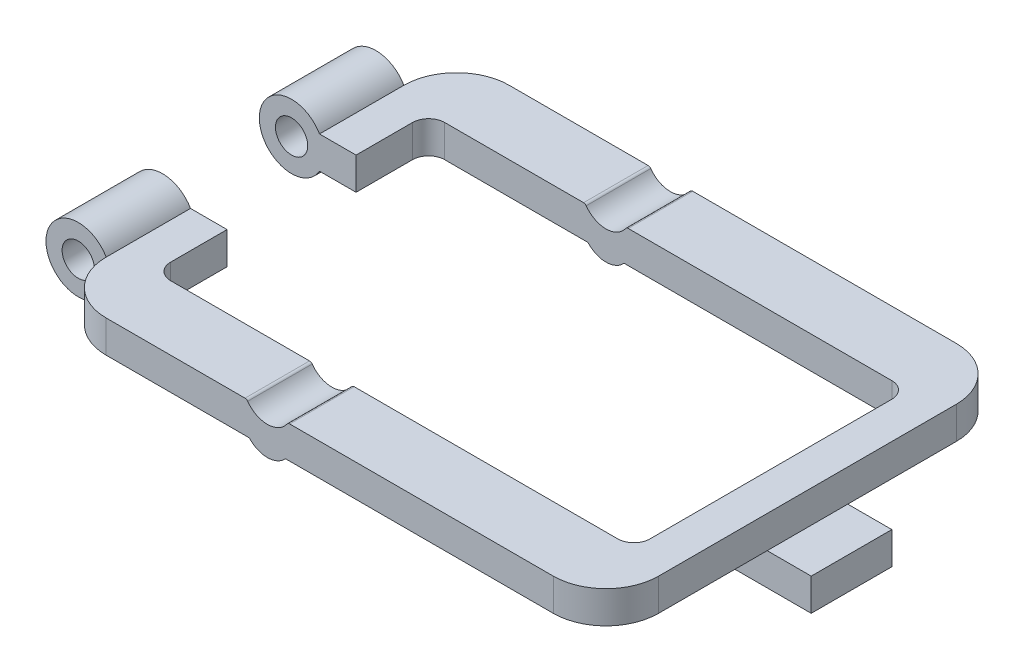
ISO-10303-21;
HEADER;
FILE_DESCRIPTION(('STEP AP214'),'2;1');
FILE_NAME('part.step','',(''),(''),'','','');
FILE_SCHEMA(('AUTOMOTIVE_DESIGN { 1 0 10303 214 1 1 1 1 }'));
ENDSEC;
DATA;
#1=APPLICATION_CONTEXT('core data for automotive mechanical design processes');
#2=APPLICATION_PROTOCOL_DEFINITION('international standard','automotive_design',2000,#1);
#3=PRODUCT_CONTEXT('',#1,'mechanical');
#4=PRODUCT('Part','Part','',(#3));
#5=PRODUCT_RELATED_PRODUCT_CATEGORY('part','',(#4));
#6=PRODUCT_DEFINITION_FORMATION('','',#4);
#7=PRODUCT_DEFINITION_CONTEXT('part definition',#1,'design');
#8=PRODUCT_DEFINITION('design','',#6,#7);
#9=PRODUCT_DEFINITION_SHAPE('','',#8);
#10=(LENGTH_UNIT() NAMED_UNIT(*) SI_UNIT(.MILLI.,.METRE.));
#11=(NAMED_UNIT(*) PLANE_ANGLE_UNIT() SI_UNIT($,.RADIAN.));
#12=(NAMED_UNIT(*) SI_UNIT($,.STERADIAN.) SOLID_ANGLE_UNIT());
#13=UNCERTAINTY_MEASURE_WITH_UNIT(LENGTH_MEASURE(1.E-05),#10,'distance_accuracy_value','');
#14=(GEOMETRIC_REPRESENTATION_CONTEXT(3) GLOBAL_UNCERTAINTY_ASSIGNED_CONTEXT((#13)) GLOBAL_UNIT_ASSIGNED_CONTEXT((#10,
#11,#12)) REPRESENTATION_CONTEXT('',''));
#15=CARTESIAN_POINT('',(0.,0.,0.));
#16=DIRECTION('',(0.,0.,1.));
#17=DIRECTION('',(1.,0.,0.));
#18=AXIS2_PLACEMENT_3D('',#15,#16,#17);
#19=CARTESIAN_POINT('',(360.,10.,125.));
#20=DIRECTION('',(0.,-1.,0.));
#21=DIRECTION('',(1.,0.,0.));
#22=AXIS2_PLACEMENT_3D('',#19,#20,#21);
#23=PLANE('',#22);
#24=DIRECTION('',(-1.,0.,0.));
#25=VECTOR('',#24,1.);
#26=CARTESIAN_POINT('',(360.,10.,-125.));
#27=LINE('',#26,#25);
#28=CARTESIAN_POINT('',(327.32,9.99999999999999,-125.));
#29=VERTEX_POINT('',#28);
#30=CARTESIAN_POINT('',(163.855539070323,9.99999999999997,-125.));
#31=VERTEX_POINT('',#30);
#32=EDGE_CURVE('E494',#29,#31,#27,.T.);
#33=ORIENTED_EDGE('',*,*,#32,.T.);
#34=DIRECTION('',(0.,0.,1.));
#35=VECTOR('',#34,1.);
#36=CARTESIAN_POINT('',(163.855539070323,9.99999999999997,125.));
#37=LINE('',#36,#35);
#38=CARTESIAN_POINT('',(163.855539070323,9.99999999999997,-85.));
#39=VERTEX_POINT('',#38);
#40=EDGE_CURVE('E558',#31,#39,#37,.T.);
#41=ORIENTED_EDGE('',*,*,#40,.T.);
#42=DIRECTION('',(-1.,0.,0.));
#43=VECTOR('',#42,1.);
#44=CARTESIAN_POINT('',(50.0000000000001,9.99999999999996,-85.));
#45=LINE('',#44,#43);
#46=CARTESIAN_POINT('',(327.32,9.99999999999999,-85.));
#47=VERTEX_POINT('',#46);
#48=EDGE_CURVE('E416',#47,#39,#45,.T.);
#49=ORIENTED_EDGE('',*,*,#48,.F.);
#50=CARTESIAN_POINT('',(327.32,9.99999999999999,-75.));
#51=DIRECTION('',(0.,1.,0.));
#52=DIRECTION('',(1.,0.,0.));
#53=AXIS2_PLACEMENT_3D('',#50,#51,#52);
#54=CIRCLE('',#53,10.);
#55=CARTESIAN_POINT('',(337.32,9.99999999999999,-75.));
#56=VERTEX_POINT('',#55);
#57=EDGE_CURVE('E413',#56,#47,#54,.T.);
#58=ORIENTED_EDGE('',*,*,#57,.F.);
#59=DIRECTION('',(0.,0.,-1.));
#60=VECTOR('',#59,1.);
#61=CARTESIAN_POINT('',(337.32,9.99999999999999,-75.));
#62=LINE('',#61,#60);
#63=CARTESIAN_POINT('',(337.32,9.99999999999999,75.));
#64=VERTEX_POINT('',#63);
#65=EDGE_CURVE('E436',#64,#56,#62,.T.);
#66=ORIENTED_EDGE('',*,*,#65,.F.);
#67=CARTESIAN_POINT('',(327.32,9.99999999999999,75.));
#68=DIRECTION('',(0.,1.,0.));
#69=DIRECTION('',(1.,0.,0.));
#70=AXIS2_PLACEMENT_3D('',#67,#68,#69);
#71=CIRCLE('',#70,10.);
#72=CARTESIAN_POINT('',(327.32,9.99999999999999,85.));
#73=VERTEX_POINT('',#72);
#74=EDGE_CURVE('E433',#73,#64,#71,.T.);
#75=ORIENTED_EDGE('',*,*,#74,.F.);
#76=DIRECTION('',(1.,0.,0.));
#77=VECTOR('',#76,1.);
#78=CARTESIAN_POINT('',(50.0000000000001,9.99999999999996,85.));
#79=LINE('',#78,#77);
#80=CARTESIAN_POINT('',(163.855539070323,9.99999999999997,85.));
#81=VERTEX_POINT('',#80);
#82=EDGE_CURVE('E429',#81,#73,#79,.T.);
#83=ORIENTED_EDGE('',*,*,#82,.F.);
#84=DIRECTION('',(0.,0.,1.));
#85=VECTOR('',#84,1.);
#86=CARTESIAN_POINT('',(163.855539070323,9.99999999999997,125.));
#87=LINE('',#86,#85);
#88=CARTESIAN_POINT('',(163.855539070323,9.99999999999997,125.));
#89=VERTEX_POINT('',#88);
#90=EDGE_CURVE('E555',#81,#89,#87,.T.);
#91=ORIENTED_EDGE('',*,*,#90,.T.);
#92=DIRECTION('',(-1.,0.,0.));
#93=VECTOR('',#92,1.);
#94=CARTESIAN_POINT('',(360.,10.,125.));
#95=LINE('',#94,#93);
#96=CARTESIAN_POINT('',(327.32,9.99999999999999,125.));
#97=VERTEX_POINT('',#96);
#98=EDGE_CURVE('E485',#97,#89,#95,.T.);
#99=ORIENTED_EDGE('',*,*,#98,.F.);
#100=CARTESIAN_POINT('',(327.32,10.,92.3205080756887));
#101=DIRECTION('',(0.,-1.,0.));
#102=DIRECTION('',(1.,0.,0.));
#103=AXIS2_PLACEMENT_3D('',#100,#101,#102);
#104=CIRCLE('',#103,32.6794919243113);
#105=CARTESIAN_POINT('',(359.999491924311,9.99999999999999,92.3205080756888));
#106=VERTEX_POINT('',#105);
#107=EDGE_CURVE('E364',#97,#106,#104,.F.);
#108=ORIENTED_EDGE('',*,*,#107,.T.);
#109=DIRECTION('',(1.,0.,0.));
#110=VECTOR('',#109,1.);
#111=CARTESIAN_POINT('',(360.,10.,92.3205080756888));
#112=LINE('',#111,#110);
#113=CARTESIAN_POINT('',(360.,10.,92.3205080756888));
#114=VERTEX_POINT('',#113);
#115=EDGE_CURVE('E361',#106,#114,#112,.T.);
#116=ORIENTED_EDGE('',*,*,#115,.T.);
#117=DIRECTION('',(0.,0.,-1.));
#118=VECTOR('',#117,1.);
#119=CARTESIAN_POINT('',(360.,10.,125.));
#120=LINE('',#119,#118);
#121=CARTESIAN_POINT('',(360.,10.,-92.3205080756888));
#122=VERTEX_POINT('',#121);
#123=EDGE_CURVE('E510',#114,#122,#120,.T.);
#124=ORIENTED_EDGE('',*,*,#123,.T.);
#125=DIRECTION('',(-1.,0.,0.));
#126=VECTOR('',#125,1.);
#127=CARTESIAN_POINT('',(360.,10.,-92.3205080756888));
#128=LINE('',#127,#126);
#129=CARTESIAN_POINT('',(359.999491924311,9.99999999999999,-92.3205080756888));
#130=VERTEX_POINT('',#129);
#131=EDGE_CURVE('E346',#122,#130,#128,.T.);
#132=ORIENTED_EDGE('',*,*,#131,.T.);
#133=CARTESIAN_POINT('',(327.32,10.,-92.3205080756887));
#134=DIRECTION('',(0.,-1.,0.));
#135=DIRECTION('',(1.,0.,0.));
#136=AXIS2_PLACEMENT_3D('',#133,#134,#135);
#137=CIRCLE('',#136,32.6794919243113);
#138=EDGE_CURVE('E349',#130,#29,#137,.F.);
#139=ORIENTED_EDGE('',*,*,#138,.T.);
#140=EDGE_LOOP('',(#33,#41,#49,#58,#66,#75,#83,#91,#99,#108,#116,#124,#132,#139));
#141=FACE_BOUND('',#140,.T.);
#142=ADVANCED_FACE('F31',(#141),#23,.F.);
#143=CARTESIAN_POINT('',(136.144460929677,9.99999999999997,125.));
#144=VERTEX_POINT('',#143);
#145=CARTESIAN_POINT('',(50.,9.99999999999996,125.));
#146=VERTEX_POINT('',#145);
#147=EDGE_CURVE('E489',#144,#146,#95,.T.);
#148=ORIENTED_EDGE('',*,*,#147,.F.);
#149=DIRECTION('',(0.,0.,1.));
#150=VECTOR('',#149,1.);
#151=CARTESIAN_POINT('',(136.144460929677,9.99999999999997,125.));
#152=LINE('',#151,#150);
#153=CARTESIAN_POINT('',(136.144460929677,9.99999999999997,85.));
#154=VERTEX_POINT('',#153);
#155=EDGE_CURVE('E589',#144,#154,#152,.F.);
#156=ORIENTED_EDGE('',*,*,#155,.T.);
#157=CARTESIAN_POINT('',(50.0000000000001,9.99999999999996,85.));
#158=VERTEX_POINT('',#157);
#159=EDGE_CURVE('E430',#158,#154,#79,.T.);
#160=ORIENTED_EDGE('',*,*,#159,.F.);
#161=CARTESIAN_POINT('',(50.,9.99999999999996,75.));
#162=DIRECTION('',(0.,1.,0.));
#163=DIRECTION('',(1.,0.,0.));
#164=AXIS2_PLACEMENT_3D('',#161,#162,#163);
#165=CIRCLE('',#164,9.99999999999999);
#166=CARTESIAN_POINT('',(40.,9.99999999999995,74.9999999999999));
#167=VERTEX_POINT('',#166);
#168=EDGE_CURVE('E426',#167,#158,#165,.T.);
#169=ORIENTED_EDGE('',*,*,#168,.F.);
#170=DIRECTION('',(0.,0.,1.));
#171=VECTOR('',#170,1.);
#172=CARTESIAN_POINT('',(40.,9.99999999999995,-74.9999999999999));
#173=LINE('',#172,#171);
#174=CARTESIAN_POINT('',(40.,9.99999999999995,40.));
#175=VERTEX_POINT('',#174);
#176=EDGE_CURVE('E422',#175,#167,#173,.T.);
#177=ORIENTED_EDGE('',*,*,#176,.F.);
#178=DIRECTION('',(1.,0.,0.));
#179=VECTOR('',#178,1.);
#180=CARTESIAN_POINT('',(360.,10.,40.));
#181=LINE('',#180,#179);
#182=CARTESIAN_POINT('',(17.3205080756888,9.99999999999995,40.));
#183=VERTEX_POINT('',#182);
#184=EDGE_CURVE('E408',#183,#175,#181,.T.);
#185=ORIENTED_EDGE('',*,*,#184,.F.);
#186=DIRECTION('',(0.,0.,-1.));
#187=VECTOR('',#186,1.);
#188=CARTESIAN_POINT('',(17.3205080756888,9.99999999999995,125.));
#189=LINE('',#188,#187);
#190=CARTESIAN_POINT('',(17.3205080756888,9.99999999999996,92.3205080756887));
#191=VERTEX_POINT('',#190);
#192=EDGE_CURVE('E508',#191,#183,#189,.T.);
#193=ORIENTED_EDGE('',*,*,#192,.F.);
#194=CARTESIAN_POINT('',(50.0000000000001,9.99999999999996,92.3205080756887));
#195=DIRECTION('',(0.,-1.,0.));
#196=DIRECTION('',(1.,0.,0.));
#197=AXIS2_PLACEMENT_3D('',#194,#195,#196);
#198=CIRCLE('',#197,32.6794919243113);
#199=EDGE_CURVE('E370',#191,#146,#198,.F.);
#200=ORIENTED_EDGE('',*,*,#199,.T.);
#201=EDGE_LOOP('',(#148,#156,#160,#169,#177,#185,#193,#200));
#202=FACE_BOUND('',#201,.T.);
#203=ADVANCED_FACE('F717',(#202),#23,.F.);
#204=CARTESIAN_POINT('',(360.,-10.,125.));
#205=DIRECTION('',(0.,1.,0.));
#206=DIRECTION('',(-1.,0.,0.));
#207=AXIS2_PLACEMENT_3D('',#204,#205,#206);
#208=PLANE('',#207);
#209=DIRECTION('',(-1.,0.,0.));
#210=VECTOR('',#209,1.);
#211=CARTESIAN_POINT('',(360.,-10.,-85.));
#212=LINE('',#211,#210);
#213=CARTESIAN_POINT('',(327.32,-9.99999999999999,-85.));
#214=VERTEX_POINT('',#213);
#215=CARTESIAN_POINT('',(162.041594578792,-9.99999999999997,-85.));
#216=VERTEX_POINT('',#215);
#217=EDGE_CURVE('E442',#214,#216,#212,.T.);
#218=ORIENTED_EDGE('',*,*,#217,.T.);
#219=DIRECTION('',(0.,0.,1.));
#220=VECTOR('',#219,1.);
#221=CARTESIAN_POINT('',(162.041594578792,-9.99999999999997,125.));
#222=LINE('',#221,#220);
#223=CARTESIAN_POINT('',(162.041594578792,-9.99999999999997,-125.));
#224=VERTEX_POINT('',#223);
#225=EDGE_CURVE('E599',#216,#224,#222,.F.);
#226=ORIENTED_EDGE('',*,*,#225,.T.);
#227=DIRECTION('',(1.,0.,0.));
#228=VECTOR('',#227,1.);
#229=CARTESIAN_POINT('',(360.,-10.,-125.));
#230=LINE('',#229,#228);
#231=CARTESIAN_POINT('',(327.32,-10.,-125.));
#232=VERTEX_POINT('',#231);
#233=EDGE_CURVE('E497',#224,#232,#230,.T.);
#234=ORIENTED_EDGE('',*,*,#233,.T.);
#235=CARTESIAN_POINT('',(327.32,-9.99999999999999,-92.3205080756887));
#236=DIRECTION('',(0.,1.,0.));
#237=DIRECTION('',(-1.,0.,0.));
#238=AXIS2_PLACEMENT_3D('',#235,#236,#237);
#239=CIRCLE('',#238,32.6794919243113);
#240=CARTESIAN_POINT('',(359.999491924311,-10.,-92.3205080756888));
#241=VERTEX_POINT('',#240);
#242=EDGE_CURVE('E549',#232,#241,#239,.F.);
#243=ORIENTED_EDGE('',*,*,#242,.T.);
#244=DIRECTION('',(1.,0.,0.));
#245=VECTOR('',#244,1.);
#246=CARTESIAN_POINT('',(360.,-10.,-92.3205080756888));
#247=LINE('',#246,#245);
#248=CARTESIAN_POINT('',(360.,-10.,-92.3205080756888));
#249=VERTEX_POINT('',#248);
#250=EDGE_CURVE('E546',#241,#249,#247,.T.);
#251=ORIENTED_EDGE('',*,*,#250,.T.);
#252=DIRECTION('',(0.,0.,-1.));
#253=VECTOR('',#252,1.);
#254=CARTESIAN_POINT('',(360.,-10.,125.));
#255=LINE('',#254,#253);
#256=CARTESIAN_POINT('',(360.,-10.,-25.));
#257=VERTEX_POINT('',#256);
#258=EDGE_CURVE('E493',#257,#249,#255,.T.);
#259=ORIENTED_EDGE('',*,*,#258,.F.);
#260=DIRECTION('',(1.,0.,0.));
#261=VECTOR('',#260,1.);
#262=CARTESIAN_POINT('',(337.32,-10.,-25.));
#263=LINE('',#262,#261);
#264=CARTESIAN_POINT('',(337.32,-10.,-25.));
#265=VERTEX_POINT('',#264);
#266=EDGE_CURVE('E662',#265,#257,#263,.T.);
#267=ORIENTED_EDGE('',*,*,#266,.F.);
#268=DIRECTION('',(0.,0.,-1.));
#269=VECTOR('',#268,1.);
#270=CARTESIAN_POINT('',(337.32,-10.,125.));
#271=LINE('',#270,#269);
#272=CARTESIAN_POINT('',(337.32,-10.,-75.));
#273=VERTEX_POINT('',#272);
#274=EDGE_CURVE('E328',#265,#273,#271,.T.);
#275=ORIENTED_EDGE('',*,*,#274,.T.);
#276=CARTESIAN_POINT('',(327.32,-9.99999999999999,-75.));
#277=DIRECTION('',(0.,1.,0.));
#278=DIRECTION('',(-1.,0.,0.));
#279=AXIS2_PLACEMENT_3D('',#276,#277,#278);
#280=CIRCLE('',#279,10.);
#281=EDGE_CURVE('E519',#273,#214,#280,.T.);
#282=ORIENTED_EDGE('',*,*,#281,.T.);
#283=EDGE_LOOP('',(#218,#226,#234,#243,#251,#259,#267,#275,#282));
#284=FACE_BOUND('',#283,.T.);
#285=ADVANCED_FACE('F723',(#284),#208,.F.);
#286=DIRECTION('',(1.,0.,0.));
#287=VECTOR('',#286,1.);
#288=CARTESIAN_POINT('',(360.,-10.,125.));
#289=LINE('',#288,#287);
#290=CARTESIAN_POINT('',(162.041594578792,-9.99999999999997,125.));
#291=VERTEX_POINT('',#290);
#292=CARTESIAN_POINT('',(327.32,-10.,125.));
#293=VERTEX_POINT('',#292);
#294=EDGE_CURVE('E488',#291,#293,#289,.T.);
#295=ORIENTED_EDGE('',*,*,#294,.F.);
#296=DIRECTION('',(0.,0.,1.));
#297=VECTOR('',#296,1.);
#298=CARTESIAN_POINT('',(162.041594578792,-9.99999999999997,125.));
#299=LINE('',#298,#297);
#300=CARTESIAN_POINT('',(162.041594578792,-9.99999999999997,85.));
#301=VERTEX_POINT('',#300);
#302=EDGE_CURVE('E46',#291,#301,#299,.F.);
#303=ORIENTED_EDGE('',*,*,#302,.T.);
#304=DIRECTION('',(1.,0.,0.));
#305=VECTOR('',#304,1.);
#306=CARTESIAN_POINT('',(360.,-10.,85.));
#307=LINE('',#306,#305);
#308=CARTESIAN_POINT('',(327.32,-9.99999999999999,85.));
#309=VERTEX_POINT('',#308);
#310=EDGE_CURVE('E464',#301,#309,#307,.T.);
#311=ORIENTED_EDGE('',*,*,#310,.T.);
#312=CARTESIAN_POINT('',(327.32,-9.99999999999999,75.));
#313=DIRECTION('',(0.,1.,0.));
#314=DIRECTION('',(-1.,0.,0.));
#315=AXIS2_PLACEMENT_3D('',#312,#313,#314);
#316=CIRCLE('',#315,10.);
#317=CARTESIAN_POINT('',(337.32,-10.,75.));
#318=VERTEX_POINT('',#317);
#319=EDGE_CURVE('E524',#309,#318,#316,.T.);
#320=ORIENTED_EDGE('',*,*,#319,.T.);
#321=CARTESIAN_POINT('',(337.32,-10.,25.));
#322=VERTEX_POINT('',#321);
#323=EDGE_CURVE('E522',#318,#322,#271,.T.);
#324=ORIENTED_EDGE('',*,*,#323,.T.);
#325=DIRECTION('',(-1.,0.,0.));
#326=VECTOR('',#325,1.);
#327=CARTESIAN_POINT('',(337.32,-10.,25.));
#328=LINE('',#327,#326);
#329=CARTESIAN_POINT('',(360.,-10.,25.));
#330=VERTEX_POINT('',#329);
#331=EDGE_CURVE('E654',#330,#322,#328,.T.);
#332=ORIENTED_EDGE('',*,*,#331,.F.);
#333=CARTESIAN_POINT('',(360.,-10.,92.3205080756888));
#334=VERTEX_POINT('',#333);
#335=EDGE_CURVE('E501',#334,#330,#255,.T.);
#336=ORIENTED_EDGE('',*,*,#335,.F.);
#337=DIRECTION('',(-1.,0.,0.));
#338=VECTOR('',#337,1.);
#339=CARTESIAN_POINT('',(360.,-10.,92.3205080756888));
#340=LINE('',#339,#338);
#341=CARTESIAN_POINT('',(359.999491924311,-10.,92.3205080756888));
#342=VERTEX_POINT('',#341);
#343=EDGE_CURVE('E538',#334,#342,#340,.T.);
#344=ORIENTED_EDGE('',*,*,#343,.T.);
#345=CARTESIAN_POINT('',(327.32,-9.99999999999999,92.3205080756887));
#346=DIRECTION('',(0.,1.,0.));
#347=DIRECTION('',(-1.,0.,0.));
#348=AXIS2_PLACEMENT_3D('',#345,#346,#347);
#349=CIRCLE('',#348,32.6794919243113);
#350=EDGE_CURVE('E543',#342,#293,#349,.F.);
#351=ORIENTED_EDGE('',*,*,#350,.T.);
#352=EDGE_LOOP('',(#295,#303,#311,#320,#324,#332,#336,#344,#351));
#353=FACE_BOUND('',#352,.T.);
#354=ADVANCED_FACE('F644',(#353),#208,.F.);
#355=CARTESIAN_POINT('',(0.,0.,125.));
#356=DIRECTION('',(0.,0.,1.));
#357=DIRECTION('',(1.,0.,0.));
#358=AXIS2_PLACEMENT_3D('',#355,#356,#357);
#359=PLANE('',#358);
#360=ORIENTED_EDGE('',*,*,#98,.T.);
#361=CARTESIAN_POINT('',(163.855539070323,7.99999999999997,125.));
#362=DIRECTION('',(0.,0.,1.));
#363=DIRECTION('',(1.,0.,0.));
#364=AXIS2_PLACEMENT_3D('',#361,#362,#363);
#365=CIRCLE('',#364,2.);
#366=CARTESIAN_POINT('',(162.225475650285,9.15883270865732,125.));
#367=VERTEX_POINT('',#366);
#368=EDGE_CURVE('E578',#89,#367,#365,.T.);
#369=ORIENTED_EDGE('',*,*,#368,.T.);
#370=CARTESIAN_POINT('',(150.,17.8500780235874,125.));
#371=DIRECTION('',(0.,0.,1.));
#372=DIRECTION('',(1.,0.,0.));
#373=AXIS2_PLACEMENT_3D('',#370,#371,#372);
#374=CIRCLE('',#373,15.);
#375=CARTESIAN_POINT('',(137.774524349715,9.15883270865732,125.));
#376=VERTEX_POINT('',#375);
#377=EDGE_CURVE('E694',#376,#367,#374,.T.);
#378=ORIENTED_EDGE('',*,*,#377,.F.);
#379=CARTESIAN_POINT('',(136.144460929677,7.99999999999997,125.));
#380=DIRECTION('',(0.,0.,1.));
#381=DIRECTION('',(1.,0.,0.));
#382=AXIS2_PLACEMENT_3D('',#379,#380,#381);
#383=CIRCLE('',#382,2.);
#384=EDGE_CURVE('E576',#376,#144,#383,.T.);
#385=ORIENTED_EDGE('',*,*,#384,.T.);
#386=ORIENTED_EDGE('',*,*,#147,.T.);
#387=DIRECTION('',(0.,1.,0.));
#388=VECTOR('',#387,1.);
#389=CARTESIAN_POINT('',(50.0000000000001,-20.,125.));
#390=LINE('',#389,#388);
#391=CARTESIAN_POINT('',(50.0000000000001,-9.99999999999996,125.));
#392=VERTEX_POINT('',#391);
#393=EDGE_CURVE('E533',#146,#392,#390,.F.);
#394=ORIENTED_EDGE('',*,*,#393,.T.);
#395=CARTESIAN_POINT('',(137.958405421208,-9.99999999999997,125.));
#396=VERTEX_POINT('',#395);
#397=EDGE_CURVE('E490',#392,#396,#289,.T.);
#398=ORIENTED_EDGE('',*,*,#397,.T.);
#399=CARTESIAN_POINT('',(137.958405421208,-12.,125.));
#400=DIRECTION('',(0.,0.,1.));
#401=DIRECTION('',(1.,0.,0.));
#402=AXIS2_PLACEMENT_3D('',#399,#400,#401);
#403=CIRCLE('',#402,2.);
#404=CARTESIAN_POINT('',(139.375063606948,-10.5882352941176,125.));
#405=VERTEX_POINT('',#404);
#406=EDGE_CURVE('E618',#396,#405,#403,.F.);
#407=ORIENTED_EDGE('',*,*,#406,.T.);
#408=CARTESIAN_POINT('',(150.,0.,125.));
#409=DIRECTION('',(0.,0.,1.));
#410=DIRECTION('',(1.,0.,0.));
#411=AXIS2_PLACEMENT_3D('',#408,#409,#410);
#412=CIRCLE('',#411,15.);
#413=CARTESIAN_POINT('',(160.624936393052,-10.5882352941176,125.));
#414=VERTEX_POINT('',#413);
#415=EDGE_CURVE('E479',#405,#414,#412,.T.);
#416=ORIENTED_EDGE('',*,*,#415,.T.);
#417=CARTESIAN_POINT('',(162.041594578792,-12.,125.));
#418=DIRECTION('',(0.,0.,1.));
#419=DIRECTION('',(1.,0.,0.));
#420=AXIS2_PLACEMENT_3D('',#417,#418,#419);
#421=CIRCLE('',#420,2.);
#422=EDGE_CURVE('E39',#414,#291,#421,.F.);
#423=ORIENTED_EDGE('',*,*,#422,.T.);
#424=ORIENTED_EDGE('',*,*,#294,.T.);
#425=DIRECTION('',(0.,1.,0.));
#426=VECTOR('',#425,1.);
#427=CARTESIAN_POINT('',(327.32,-20.,125.));
#428=LINE('',#427,#426);
#429=EDGE_CURVE('E352',#293,#97,#428,.T.);
#430=ORIENTED_EDGE('',*,*,#429,.T.);
#431=EDGE_LOOP('',(#360,#369,#378,#385,#386,#394,#398,#407,#416,#423,#424,#430));
#432=FACE_BOUND('',#431,.T.);
#433=ADVANCED_FACE('F636',(#432),#359,.T.);
#434=CARTESIAN_POINT('',(0.,0.,-125.));
#435=DIRECTION('',(0.,0.,1.));
#436=DIRECTION('',(1.,0.,0.));
#437=AXIS2_PLACEMENT_3D('',#434,#435,#436);
#438=PLANE('',#437);
#439=CARTESIAN_POINT('',(150.,17.8500780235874,-125.));
#440=DIRECTION('',(0.,0.,1.));
#441=DIRECTION('',(1.,0.,0.));
#442=AXIS2_PLACEMENT_3D('',#439,#440,#441);
#443=CIRCLE('',#442,15.);
#444=CARTESIAN_POINT('',(137.774524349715,9.15883270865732,-125.));
#445=VERTEX_POINT('',#444);
#446=CARTESIAN_POINT('',(162.225475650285,9.15883270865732,-125.));
#447=VERTEX_POINT('',#446);
#448=EDGE_CURVE('E699',#445,#447,#443,.T.);
#449=ORIENTED_EDGE('',*,*,#448,.T.);
#450=CARTESIAN_POINT('',(163.855539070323,7.99999999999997,-125.));
#451=DIRECTION('',(0.,0.,1.));
#452=DIRECTION('',(1.,0.,0.));
#453=AXIS2_PLACEMENT_3D('',#450,#451,#452);
#454=CIRCLE('',#453,2.);
#455=EDGE_CURVE('E572',#447,#31,#454,.F.);
#456=ORIENTED_EDGE('',*,*,#455,.T.);
#457=ORIENTED_EDGE('',*,*,#32,.F.);
#458=DIRECTION('',(0.,1.,0.));
#459=VECTOR('',#458,1.);
#460=CARTESIAN_POINT('',(327.32,-20.,-125.));
#461=LINE('',#460,#459);
#462=EDGE_CURVE('E339',#232,#29,#461,.T.);
#463=ORIENTED_EDGE('',*,*,#462,.F.);
#464=ORIENTED_EDGE('',*,*,#233,.F.);
#465=CARTESIAN_POINT('',(162.041594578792,-12.,-125.));
#466=DIRECTION('',(0.,0.,1.));
#467=DIRECTION('',(1.,0.,0.));
#468=AXIS2_PLACEMENT_3D('',#465,#466,#467);
#469=CIRCLE('',#468,2.);
#470=CARTESIAN_POINT('',(160.624936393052,-10.5882352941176,-125.));
#471=VERTEX_POINT('',#470);
#472=EDGE_CURVE('E616',#224,#471,#469,.T.);
#473=ORIENTED_EDGE('',*,*,#472,.T.);
#474=CARTESIAN_POINT('',(150.,0.,-125.));
#475=DIRECTION('',(0.,0.,1.));
#476=DIRECTION('',(1.,0.,0.));
#477=AXIS2_PLACEMENT_3D('',#474,#475,#476);
#478=CIRCLE('',#477,15.);
#479=CARTESIAN_POINT('',(139.375063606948,-10.5882352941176,-125.));
#480=VERTEX_POINT('',#479);
#481=EDGE_CURVE('E480',#471,#480,#478,.F.);
#482=ORIENTED_EDGE('',*,*,#481,.T.);
#483=CARTESIAN_POINT('',(137.958405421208,-12.,-125.));
#484=DIRECTION('',(0.,0.,1.));
#485=DIRECTION('',(1.,0.,0.));
#486=AXIS2_PLACEMENT_3D('',#483,#484,#485);
#487=CIRCLE('',#486,2.);
#488=CARTESIAN_POINT('',(137.958405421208,-9.99999999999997,-125.));
#489=VERTEX_POINT('',#488);
#490=EDGE_CURVE('E612',#480,#489,#487,.T.);
#491=ORIENTED_EDGE('',*,*,#490,.T.);
#492=CARTESIAN_POINT('',(50.0000000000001,-9.99999999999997,-125.));
#493=VERTEX_POINT('',#492);
#494=EDGE_CURVE('E498',#493,#489,#230,.T.);
#495=ORIENTED_EDGE('',*,*,#494,.F.);
#496=DIRECTION('',(0.,1.,0.));
#497=VECTOR('',#496,1.);
#498=CARTESIAN_POINT('',(50.0000000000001,-20.,-125.));
#499=LINE('',#498,#497);
#500=CARTESIAN_POINT('',(50.0000000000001,9.99999999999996,-125.));
#501=VERTEX_POINT('',#500);
#502=EDGE_CURVE('E527',#501,#493,#499,.F.);
#503=ORIENTED_EDGE('',*,*,#502,.F.);
#504=CARTESIAN_POINT('',(136.144460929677,9.99999999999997,-125.));
#505=VERTEX_POINT('',#504);
#506=EDGE_CURVE('E483',#505,#501,#27,.T.);
#507=ORIENTED_EDGE('',*,*,#506,.F.);
#508=CARTESIAN_POINT('',(136.144460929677,7.99999999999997,-125.));
#509=DIRECTION('',(0.,0.,1.));
#510=DIRECTION('',(1.,0.,0.));
#511=AXIS2_PLACEMENT_3D('',#508,#509,#510);
#512=CIRCLE('',#511,2.);
#513=EDGE_CURVE('E570',#505,#445,#512,.F.);
#514=ORIENTED_EDGE('',*,*,#513,.T.);
#515=EDGE_LOOP('',(#449,#456,#457,#463,#464,#473,#482,#491,#495,#503,#507,#514));
#516=FACE_BOUND('',#515,.T.);
#517=ADVANCED_FACE('F752',(#516),#438,.F.);
#518=DIRECTION('',(1.,0.,0.));
#519=VECTOR('',#518,1.);
#520=CARTESIAN_POINT('',(360.,-10.,85.));
#521=LINE('',#520,#519);
#522=CARTESIAN_POINT('',(50.0000000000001,-9.99999999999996,85.));
#523=VERTEX_POINT('',#522);
#524=CARTESIAN_POINT('',(137.958405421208,-9.99999999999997,85.));
#525=VERTEX_POINT('',#524);
#526=EDGE_CURVE('E466',#523,#525,#521,.T.);
#527=ORIENTED_EDGE('',*,*,#526,.T.);
#528=DIRECTION('',(0.,0.,1.));
#529=VECTOR('',#528,1.);
#530=CARTESIAN_POINT('',(137.958405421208,-9.99999999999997,125.));
#531=LINE('',#530,#529);
#532=EDGE_CURVE('E601',#525,#396,#531,.T.);
#533=ORIENTED_EDGE('',*,*,#532,.T.);
#534=ORIENTED_EDGE('',*,*,#397,.F.);
#535=CARTESIAN_POINT('',(50.0000000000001,-9.99999999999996,92.3205080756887));
#536=DIRECTION('',(0.,1.,0.));
#537=DIRECTION('',(-1.,0.,0.));
#538=AXIS2_PLACEMENT_3D('',#535,#536,#537);
#539=CIRCLE('',#538,32.6794919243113);
#540=CARTESIAN_POINT('',(17.3205080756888,-9.99999999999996,92.3205080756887));
#541=VERTEX_POINT('',#540);
#542=EDGE_CURVE('E373',#392,#541,#539,.F.);
#543=ORIENTED_EDGE('',*,*,#542,.T.);
#544=DIRECTION('',(0.,0.,-1.));
#545=VECTOR('',#544,1.);
#546=CARTESIAN_POINT('',(17.3205080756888,-9.99999999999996,125.));
#547=LINE('',#546,#545);
#548=CARTESIAN_POINT('',(17.3205080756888,-9.99999999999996,40.));
#549=VERTEX_POINT('',#548);
#550=EDGE_CURVE('E505',#541,#549,#547,.T.);
#551=ORIENTED_EDGE('',*,*,#550,.T.);
#552=DIRECTION('',(-1.,0.,0.));
#553=VECTOR('',#552,1.);
#554=CARTESIAN_POINT('',(360.,-10.,40.));
#555=LINE('',#554,#553);
#556=CARTESIAN_POINT('',(40.,-9.99999999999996,40.));
#557=VERTEX_POINT('',#556);
#558=EDGE_CURVE('E409',#557,#549,#555,.T.);
#559=ORIENTED_EDGE('',*,*,#558,.F.);
#560=DIRECTION('',(0.,0.,1.));
#561=VECTOR('',#560,1.);
#562=CARTESIAN_POINT('',(40.,-9.99999999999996,125.));
#563=LINE('',#562,#561);
#564=CARTESIAN_POINT('',(40.,-9.99999999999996,74.9999999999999));
#565=VERTEX_POINT('',#564);
#566=EDGE_CURVE('E472',#557,#565,#563,.T.);
#567=ORIENTED_EDGE('',*,*,#566,.T.);
#568=CARTESIAN_POINT('',(50.,-9.99999999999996,75.));
#569=DIRECTION('',(0.,1.,0.));
#570=DIRECTION('',(-1.,0.,0.));
#571=AXIS2_PLACEMENT_3D('',#568,#569,#570);
#572=CIRCLE('',#571,9.99999999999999);
#573=EDGE_CURVE('E476',#565,#523,#572,.T.);
#574=ORIENTED_EDGE('',*,*,#573,.T.);
#575=EDGE_LOOP('',(#527,#533,#534,#543,#551,#559,#567,#574));
#576=FACE_BOUND('',#575,.T.);
#577=ADVANCED_FACE('F631',(#576),#208,.F.);
#578=ORIENTED_EDGE('',*,*,#494,.T.);
#579=DIRECTION('',(0.,0.,1.));
#580=VECTOR('',#579,1.);
#581=CARTESIAN_POINT('',(137.958405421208,-9.99999999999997,125.));
#582=LINE('',#581,#580);
#583=CARTESIAN_POINT('',(137.958405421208,-9.99999999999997,-85.));
#584=VERTEX_POINT('',#583);
#585=EDGE_CURVE('E591',#489,#584,#582,.T.);
#586=ORIENTED_EDGE('',*,*,#585,.T.);
#587=DIRECTION('',(-1.,0.,0.));
#588=VECTOR('',#587,1.);
#589=CARTESIAN_POINT('',(360.,-10.,-85.));
#590=LINE('',#589,#588);
#591=CARTESIAN_POINT('',(50.0000000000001,-9.99999999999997,-85.));
#592=VERTEX_POINT('',#591);
#593=EDGE_CURVE('E462',#584,#592,#590,.T.);
#594=ORIENTED_EDGE('',*,*,#593,.T.);
#595=CARTESIAN_POINT('',(50.,-9.99999999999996,-75.));
#596=DIRECTION('',(0.,1.,0.));
#597=DIRECTION('',(-1.,0.,0.));
#598=AXIS2_PLACEMENT_3D('',#595,#596,#597);
#599=CIRCLE('',#598,9.99999999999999);
#600=CARTESIAN_POINT('',(40.,-9.99999999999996,-74.9999999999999));
#601=VERTEX_POINT('',#600);
#602=EDGE_CURVE('E469',#592,#601,#599,.T.);
#603=ORIENTED_EDGE('',*,*,#602,.T.);
#604=CARTESIAN_POINT('',(40.,-9.99999999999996,-40.));
#605=VERTEX_POINT('',#604);
#606=EDGE_CURVE('E473',#601,#605,#563,.T.);
#607=ORIENTED_EDGE('',*,*,#606,.T.);
#608=DIRECTION('',(1.,0.,0.));
#609=VECTOR('',#608,1.);
#610=CARTESIAN_POINT('',(360.,-10.,-40.));
#611=LINE('',#610,#609);
#612=CARTESIAN_POINT('',(17.3205080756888,-9.99999999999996,-40.));
#613=VERTEX_POINT('',#612);
#614=EDGE_CURVE('E399',#613,#605,#611,.T.);
#615=ORIENTED_EDGE('',*,*,#614,.F.);
#616=CARTESIAN_POINT('',(17.3205080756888,-9.99999999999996,-92.3205080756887));
#617=VERTEX_POINT('',#616);
#618=EDGE_CURVE('E504',#613,#617,#547,.T.);
#619=ORIENTED_EDGE('',*,*,#618,.T.);
#620=CARTESIAN_POINT('',(50.0000000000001,-9.99999999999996,-92.3205080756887));
#621=DIRECTION('',(0.,1.,0.));
#622=DIRECTION('',(-1.,0.,0.));
#623=AXIS2_PLACEMENT_3D('',#620,#621,#622);
#624=CIRCLE('',#623,32.6794919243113);
#625=EDGE_CURVE('E385',#617,#493,#624,.F.);
#626=ORIENTED_EDGE('',*,*,#625,.T.);
#627=EDGE_LOOP('',(#578,#586,#594,#603,#607,#615,#619,#626));
#628=FACE_BOUND('',#627,.T.);
#629=ADVANCED_FACE('F729',(#628),#208,.F.);
#630=CARTESIAN_POINT('',(136.144460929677,9.99999999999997,-85.));
#631=VERTEX_POINT('',#630);
#632=CARTESIAN_POINT('',(50.0000000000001,9.99999999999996,-85.));
#633=VERTEX_POINT('',#632);
#634=EDGE_CURVE('E415',#631,#633,#45,.T.);
#635=ORIENTED_EDGE('',*,*,#634,.F.);
#636=DIRECTION('',(0.,0.,1.));
#637=VECTOR('',#636,1.);
#638=CARTESIAN_POINT('',(136.144460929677,9.99999999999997,125.));
#639=LINE('',#638,#637);
#640=EDGE_CURVE('E574',#631,#505,#639,.F.);
#641=ORIENTED_EDGE('',*,*,#640,.T.);
#642=ORIENTED_EDGE('',*,*,#506,.T.);
#643=CARTESIAN_POINT('',(50.0000000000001,9.99999999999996,-92.3205080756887));
#644=DIRECTION('',(0.,-1.,0.));
#645=DIRECTION('',(1.,0.,0.));
#646=AXIS2_PLACEMENT_3D('',#643,#644,#645);
#647=CIRCLE('',#646,32.6794919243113);
#648=CARTESIAN_POINT('',(17.3205080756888,9.99999999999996,-92.3205080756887));
#649=VERTEX_POINT('',#648);
#650=EDGE_CURVE('E382',#501,#649,#647,.F.);
#651=ORIENTED_EDGE('',*,*,#650,.T.);
#652=CARTESIAN_POINT('',(17.3205080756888,9.99999999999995,-40.));
#653=VERTEX_POINT('',#652);
#654=EDGE_CURVE('E507',#653,#649,#189,.T.);
#655=ORIENTED_EDGE('',*,*,#654,.F.);
#656=DIRECTION('',(-1.,0.,0.));
#657=VECTOR('',#656,1.);
#658=CARTESIAN_POINT('',(360.,10.,-40.));
#659=LINE('',#658,#657);
#660=CARTESIAN_POINT('',(40.,9.99999999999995,-40.));
#661=VERTEX_POINT('',#660);
#662=EDGE_CURVE('E400',#661,#653,#659,.T.);
#663=ORIENTED_EDGE('',*,*,#662,.F.);
#664=CARTESIAN_POINT('',(40.,9.99999999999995,-74.9999999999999));
#665=VERTEX_POINT('',#664);
#666=EDGE_CURVE('E423',#665,#661,#173,.T.);
#667=ORIENTED_EDGE('',*,*,#666,.F.);
#668=CARTESIAN_POINT('',(50.,9.99999999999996,-75.));
#669=DIRECTION('',(0.,1.,0.));
#670=DIRECTION('',(1.,0.,0.));
#671=AXIS2_PLACEMENT_3D('',#668,#669,#670);
#672=CIRCLE('',#671,9.99999999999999);
#673=EDGE_CURVE('E419',#633,#665,#672,.T.);
#674=ORIENTED_EDGE('',*,*,#673,.F.);
#675=EDGE_LOOP('',(#635,#641,#642,#651,#655,#663,#667,#674));
#676=FACE_BOUND('',#675,.T.);
#677=ADVANCED_FACE('F719',(#676),#23,.F.);
#678=CARTESIAN_POINT('',(0.,0.,125.));
#679=DIRECTION('',(0.,0.,-1.));
#680=DIRECTION('',(-1.,0.,0.));
#681=AXIS2_PLACEMENT_3D('',#678,#679,#680);
#682=CYLINDRICAL_SURFACE('',#681,20.);
#683=ORIENTED_EDGE('',*,*,#550,.F.);
#684=CARTESIAN_POINT('',(0.,0.,92.3205080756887));
#685=DIRECTION('',(0.,0.,-1.));
#686=DIRECTION('',(-1.,0.,0.));
#687=AXIS2_PLACEMENT_3D('',#684,#685,#686);
#688=CIRCLE('',#687,20.);
#689=EDGE_CURVE('E377',#541,#191,#688,.T.);
#690=ORIENTED_EDGE('',*,*,#689,.T.);
#691=ORIENTED_EDGE('',*,*,#192,.T.);
#692=CARTESIAN_POINT('',(0.,0.,40.));
#693=DIRECTION('',(0.,0.,-1.));
#694=DIRECTION('',(-1.,0.,0.));
#695=AXIS2_PLACEMENT_3D('',#692,#693,#694);
#696=CIRCLE('',#695,20.);
#697=EDGE_CURVE('E405',#549,#183,#696,.T.);
#698=ORIENTED_EDGE('',*,*,#697,.F.);
#699=EDGE_LOOP('',(#683,#690,#691,#698));
#700=FACE_BOUND('',#699,.T.);
#701=ADVANCED_FACE('F728',(#700),#682,.T.);
#702=ORIENTED_EDGE('',*,*,#654,.T.);
#703=CARTESIAN_POINT('',(0.,0.,-92.3205080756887));
#704=DIRECTION('',(0.,0.,1.));
#705=DIRECTION('',(1.,0.,0.));
#706=AXIS2_PLACEMENT_3D('',#703,#704,#705);
#707=CIRCLE('',#706,20.);
#708=EDGE_CURVE('E389',#649,#617,#707,.T.);
#709=ORIENTED_EDGE('',*,*,#708,.T.);
#710=ORIENTED_EDGE('',*,*,#618,.F.);
#711=CARTESIAN_POINT('',(0.,0.,-40.));
#712=DIRECTION('',(0.,0.,1.));
#713=DIRECTION('',(1.,0.,0.));
#714=AXIS2_PLACEMENT_3D('',#711,#712,#713);
#715=CIRCLE('',#714,20.);
#716=EDGE_CURVE('E397',#653,#613,#715,.T.);
#717=ORIENTED_EDGE('',*,*,#716,.F.);
#718=EDGE_LOOP('',(#702,#709,#710,#717));
#719=FACE_BOUND('',#718,.T.);
#720=ADVANCED_FACE('F735',(#719),#682,.T.);
#721=CARTESIAN_POINT('',(40.,-20.,-74.9999999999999));
#722=DIRECTION('',(-1.,0.,0.));
#723=DIRECTION('',(0.,-1.,0.));
#724=AXIS2_PLACEMENT_3D('',#721,#722,#723);
#725=PLANE('',#724);
#726=DIRECTION('',(0.,-1.,0.));
#727=VECTOR('',#726,1.);
#728=CARTESIAN_POINT('',(40.,20.,40.));
#729=LINE('',#728,#727);
#730=EDGE_CURVE('E394',#175,#557,#729,.T.);
#731=ORIENTED_EDGE('',*,*,#730,.F.);
#732=ORIENTED_EDGE('',*,*,#176,.T.);
#733=DIRECTION('',(0.,1.,0.));
#734=VECTOR('',#733,1.);
#735=CARTESIAN_POINT('',(40.,-20.,74.9999999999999));
#736=LINE('',#735,#734);
#737=EDGE_CURVE('E450',#565,#167,#736,.T.);
#738=ORIENTED_EDGE('',*,*,#737,.F.);
#739=ORIENTED_EDGE('',*,*,#566,.F.);
#740=EDGE_LOOP('',(#731,#732,#738,#739));
#741=FACE_BOUND('',#740,.T.);
#742=ADVANCED_FACE('F824',(#741),#725,.F.);
#743=DIRECTION('',(0.,-1.,0.));
#744=VECTOR('',#743,1.);
#745=CARTESIAN_POINT('',(40.,20.,-40.));
#746=LINE('',#745,#744);
#747=EDGE_CURVE('E391',#661,#605,#746,.T.);
#748=ORIENTED_EDGE('',*,*,#747,.T.);
#749=ORIENTED_EDGE('',*,*,#606,.F.);
#750=DIRECTION('',(0.,1.,0.));
#751=VECTOR('',#750,1.);
#752=CARTESIAN_POINT('',(40.,-20.,-74.9999999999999));
#753=LINE('',#752,#751);
#754=EDGE_CURVE('E453',#601,#665,#753,.T.);
#755=ORIENTED_EDGE('',*,*,#754,.T.);
#756=ORIENTED_EDGE('',*,*,#666,.T.);
#757=EDGE_LOOP('',(#748,#749,#755,#756));
#758=FACE_BOUND('',#757,.T.);
#759=ADVANCED_FACE('F806',(#758),#725,.F.);
#760=CARTESIAN_POINT('',(0.,0.,-125.));
#761=DIRECTION('',(0.,0.,1.));
#762=DIRECTION('',(1.,0.,0.));
#763=AXIS2_PLACEMENT_3D('',#760,#761,#762);
#764=CYLINDRICAL_SURFACE('',#763,10.);
#765=CARTESIAN_POINT('',(0.,0.,92.3205080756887));
#766=DIRECTION('',(0.,0.,-1.));
#767=DIRECTION('',(-1.,0.,0.));
#768=AXIS2_PLACEMENT_3D('',#765,#766,#767);
#769=CIRCLE('',#768,10.);
#770=CARTESIAN_POINT('',(-10.,0.,92.3205080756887));
#771=VERTEX_POINT('',#770);
#772=EDGE_CURVE('E376',#771,#771,#769,.F.);
#773=ORIENTED_EDGE('',*,*,#772,.T.);
#774=EDGE_LOOP('',(#773));
#775=FACE_BOUND('',#774,.T.);
#776=CARTESIAN_POINT('',(0.,0.,40.));
#777=DIRECTION('',(0.,0.,-1.));
#778=DIRECTION('',(-1.,0.,0.));
#779=AXIS2_PLACEMENT_3D('',#776,#777,#778);
#780=CIRCLE('',#779,10.);
#781=CARTESIAN_POINT('',(-10.,0.,40.));
#782=VERTEX_POINT('',#781);
#783=EDGE_CURVE('E404',#782,#782,#780,.F.);
#784=ORIENTED_EDGE('',*,*,#783,.F.);
#785=EDGE_LOOP('',(#784));
#786=FACE_BOUND('',#785,.T.);
#787=ADVANCED_FACE('F881',(#775,#786),#764,.F.);
#788=CARTESIAN_POINT('',(0.,0.,-92.3205080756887));
#789=DIRECTION('',(0.,0.,1.));
#790=DIRECTION('',(1.,0.,0.));
#791=AXIS2_PLACEMENT_3D('',#788,#789,#790);
#792=CIRCLE('',#791,10.);
#793=CARTESIAN_POINT('',(10.,0.,-92.3205080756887));
#794=VERTEX_POINT('',#793);
#795=EDGE_CURVE('E388',#794,#794,#792,.F.);
#796=ORIENTED_EDGE('',*,*,#795,.T.);
#797=EDGE_LOOP('',(#796));
#798=FACE_BOUND('',#797,.T.);
#799=CARTESIAN_POINT('',(0.,0.,-40.));
#800=DIRECTION('',(0.,0.,1.));
#801=DIRECTION('',(1.,0.,0.));
#802=AXIS2_PLACEMENT_3D('',#799,#800,#801);
#803=CIRCLE('',#802,10.);
#804=CARTESIAN_POINT('',(10.,0.,-40.));
#805=VERTEX_POINT('',#804);
#806=EDGE_CURVE('E396',#805,#805,#803,.F.);
#807=ORIENTED_EDGE('',*,*,#806,.F.);
#808=EDGE_LOOP('',(#807));
#809=FACE_BOUND('',#808,.T.);
#810=ADVANCED_FACE('F889',(#798,#809),#764,.F.);
#811=CARTESIAN_POINT('',(150.,0.,-147.912878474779));
#812=DIRECTION('',(0.,0.,1.));
#813=DIRECTION('',(1.,0.,0.));
#814=AXIS2_PLACEMENT_3D('',#811,#812,#813);
#815=CYLINDRICAL_SURFACE('',#814,15.);
#816=ORIENTED_EDGE('',*,*,#415,.F.);
#817=DIRECTION('',(0.,0.,1.));
#818=VECTOR('',#817,1.);
#819=CARTESIAN_POINT('',(139.375063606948,-10.5882352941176,-147.912878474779));
#820=LINE('',#819,#818);
#821=CARTESIAN_POINT('',(139.375063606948,-10.5882352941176,85.));
#822=VERTEX_POINT('',#821);
#823=EDGE_CURVE('E607',#405,#822,#820,.F.);
#824=ORIENTED_EDGE('',*,*,#823,.T.);
#825=CARTESIAN_POINT('',(150.,0.,85.));
#826=DIRECTION('',(0.,0.,1.));
#827=DIRECTION('',(1.,0.,0.));
#828=AXIS2_PLACEMENT_3D('',#825,#826,#827);
#829=CIRCLE('',#828,15.);
#830=CARTESIAN_POINT('',(160.624936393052,-10.5882352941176,85.));
#831=VERTEX_POINT('',#830);
#832=EDGE_CURVE('E516',#831,#822,#829,.F.);
#833=ORIENTED_EDGE('',*,*,#832,.F.);
#834=DIRECTION('',(0.,0.,1.));
#835=VECTOR('',#834,1.);
#836=CARTESIAN_POINT('',(160.624936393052,-10.5882352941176,-147.912878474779));
#837=LINE('',#836,#835);
#838=EDGE_CURVE('E604',#831,#414,#837,.T.);
#839=ORIENTED_EDGE('',*,*,#838,.T.);
#840=EDGE_LOOP('',(#816,#824,#833,#839));
#841=FACE_BOUND('',#840,.T.);
#842=ADVANCED_FACE('F638',(#841),#815,.T.);
#843=CARTESIAN_POINT('',(360.,10.,125.));
#844=DIRECTION('',(-1.,0.,0.));
#845=DIRECTION('',(0.,0.,1.));
#846=AXIS2_PLACEMENT_3D('',#843,#844,#845);
#847=PLANE('',#846);
#848=ORIENTED_EDGE('',*,*,#335,.T.);
#849=DIRECTION('',(0.,0.,1.));
#850=VECTOR('',#849,1.);
#851=CARTESIAN_POINT('',(360.,-10.,125.));
#852=LINE('',#851,#850);
#853=EDGE_CURVE('E330',#257,#330,#852,.T.);
#854=ORIENTED_EDGE('',*,*,#853,.F.);
#855=ORIENTED_EDGE('',*,*,#258,.T.);
#856=DIRECTION('',(0.,1.,0.));
#857=VECTOR('',#856,1.);
#858=CARTESIAN_POINT('',(360.,10.,-92.3205080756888));
#859=LINE('',#858,#857);
#860=EDGE_CURVE('E341',#249,#122,#859,.T.);
#861=ORIENTED_EDGE('',*,*,#860,.T.);
#862=ORIENTED_EDGE('',*,*,#123,.F.);
#863=DIRECTION('',(0.,-1.,0.));
#864=VECTOR('',#863,1.);
#865=CARTESIAN_POINT('',(360.,10.,92.3205080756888));
#866=LINE('',#865,#864);
#867=EDGE_CURVE('E356',#114,#334,#866,.T.);
#868=ORIENTED_EDGE('',*,*,#867,.T.);
#869=EDGE_LOOP('',(#848,#854,#855,#861,#862,#868));
#870=FACE_BOUND('',#869,.T.);
#871=ADVANCED_FACE('F675',(#870),#847,.F.);
#872=CARTESIAN_POINT('',(150.,0.,-85.));
#873=DIRECTION('',(0.,0.,-1.));
#874=DIRECTION('',(-1.,0.,0.));
#875=AXIS2_PLACEMENT_3D('',#872,#873,#874);
#876=CIRCLE('',#875,15.);
#877=CARTESIAN_POINT('',(139.375063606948,-10.5882352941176,-85.));
#878=VERTEX_POINT('',#877);
#879=CARTESIAN_POINT('',(160.624936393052,-10.5882352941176,-85.));
#880=VERTEX_POINT('',#879);
#881=EDGE_CURVE('E513',#878,#880,#876,.F.);
#882=ORIENTED_EDGE('',*,*,#881,.F.);
#883=DIRECTION('',(0.,0.,1.));
#884=VECTOR('',#883,1.);
#885=CARTESIAN_POINT('',(139.375063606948,-10.5882352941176,-147.912878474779));
#886=LINE('',#885,#884);
#887=EDGE_CURVE('E597',#878,#480,#886,.F.);
#888=ORIENTED_EDGE('',*,*,#887,.T.);
#889=ORIENTED_EDGE('',*,*,#481,.F.);
#890=DIRECTION('',(0.,0.,1.));
#891=VECTOR('',#890,1.);
#892=CARTESIAN_POINT('',(160.624936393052,-10.5882352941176,-147.912878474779));
#893=LINE('',#892,#891);
#894=EDGE_CURVE('E594',#471,#880,#893,.T.);
#895=ORIENTED_EDGE('',*,*,#894,.T.);
#896=EDGE_LOOP('',(#882,#888,#889,#895));
#897=FACE_BOUND('',#896,.T.);
#898=ADVANCED_FACE('F781',(#897),#815,.T.);
#899=CARTESIAN_POINT('',(50.,-20.,75.));
#900=DIRECTION('',(0.,1.,0.));
#901=DIRECTION('',(-1.,0.,0.));
#902=AXIS2_PLACEMENT_3D('',#899,#900,#901);
#903=CYLINDRICAL_SURFACE('',#902,9.99999999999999);
#904=ORIENTED_EDGE('',*,*,#737,.T.);
#905=ORIENTED_EDGE('',*,*,#168,.T.);
#906=DIRECTION('',(0.,1.,0.));
#907=VECTOR('',#906,1.);
#908=CARTESIAN_POINT('',(50.0000000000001,-20.,85.));
#909=LINE('',#908,#907);
#910=EDGE_CURVE('E448',#523,#158,#909,.T.);
#911=ORIENTED_EDGE('',*,*,#910,.F.);
#912=ORIENTED_EDGE('',*,*,#573,.F.);
#913=EDGE_LOOP('',(#904,#905,#911,#912));
#914=FACE_BOUND('',#913,.T.);
#915=ADVANCED_FACE('F812',(#914),#903,.F.);
#916=CARTESIAN_POINT('',(50.,-20.,-75.));
#917=DIRECTION('',(0.,1.,0.));
#918=DIRECTION('',(-1.,0.,0.));
#919=AXIS2_PLACEMENT_3D('',#916,#917,#918);
#920=CYLINDRICAL_SURFACE('',#919,9.99999999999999);
#921=DIRECTION('',(0.,1.,0.));
#922=VECTOR('',#921,1.);
#923=CARTESIAN_POINT('',(50.0000000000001,-20.,-85.));
#924=LINE('',#923,#922);
#925=EDGE_CURVE('E455',#592,#633,#924,.T.);
#926=ORIENTED_EDGE('',*,*,#925,.T.);
#927=ORIENTED_EDGE('',*,*,#673,.T.);
#928=ORIENTED_EDGE('',*,*,#754,.F.);
#929=ORIENTED_EDGE('',*,*,#602,.F.);
#930=EDGE_LOOP('',(#926,#927,#928,#929));
#931=FACE_BOUND('',#930,.T.);
#932=ADVANCED_FACE('F809',(#931),#920,.F.);
#933=CARTESIAN_POINT('',(327.32,-20.,-75.));
#934=DIRECTION('',(0.,1.,0.));
#935=DIRECTION('',(-1.,0.,0.));
#936=AXIS2_PLACEMENT_3D('',#933,#934,#935);
#937=CYLINDRICAL_SURFACE('',#936,10.);
#938=DIRECTION('',(0.,1.,0.));
#939=VECTOR('',#938,1.);
#940=CARTESIAN_POINT('',(337.32,-20.,-75.));
#941=LINE('',#940,#939);
#942=EDGE_CURVE('E440',#273,#56,#941,.T.);
#943=ORIENTED_EDGE('',*,*,#942,.T.);
#944=ORIENTED_EDGE('',*,*,#57,.T.);
#945=DIRECTION('',(0.,1.,0.));
#946=VECTOR('',#945,1.);
#947=CARTESIAN_POINT('',(327.32,-20.,-85.));
#948=LINE('',#947,#946);
#949=EDGE_CURVE('E439',#214,#47,#948,.T.);
#950=ORIENTED_EDGE('',*,*,#949,.F.);
#951=ORIENTED_EDGE('',*,*,#281,.F.);
#952=EDGE_LOOP('',(#943,#944,#950,#951));
#953=FACE_BOUND('',#952,.T.);
#954=ADVANCED_FACE('F811',(#953),#937,.F.);
#955=CARTESIAN_POINT('',(337.32,-20.,-75.));
#956=DIRECTION('',(1.,0.,0.));
#957=DIRECTION('',(0.,1.,0.));
#958=AXIS2_PLACEMENT_3D('',#955,#956,#957);
#959=PLANE('',#958);
#960=DIRECTION('',(0.,1.,0.));
#961=VECTOR('',#960,1.);
#962=CARTESIAN_POINT('',(337.32,-20.,75.));
#963=LINE('',#962,#961);
#964=EDGE_CURVE('E443',#318,#64,#963,.T.);
#965=ORIENTED_EDGE('',*,*,#964,.T.);
#966=ORIENTED_EDGE('',*,*,#65,.T.);
#967=ORIENTED_EDGE('',*,*,#942,.F.);
#968=ORIENTED_EDGE('',*,*,#274,.F.);
#969=DIRECTION('',(0.,1.,0.));
#970=VECTOR('',#969,1.);
#971=CARTESIAN_POINT('',(337.32,-30.,-25.));
#972=LINE('',#971,#970);
#973=CARTESIAN_POINT('',(337.32,-30.,-25.));
#974=VERTEX_POINT('',#973);
#975=EDGE_CURVE('E309',#974,#265,#972,.T.);
#976=ORIENTED_EDGE('',*,*,#975,.F.);
#977=DIRECTION('',(0.,0.,-1.));
#978=VECTOR('',#977,1.);
#979=CARTESIAN_POINT('',(337.32,-30.,25.));
#980=LINE('',#979,#978);
#981=CARTESIAN_POINT('',(337.32,-30.,25.));
#982=VERTEX_POINT('',#981);
#983=EDGE_CURVE('E315',#982,#974,#980,.T.);
#984=ORIENTED_EDGE('',*,*,#983,.F.);
#985=DIRECTION('',(0.,1.,0.));
#986=VECTOR('',#985,1.);
#987=CARTESIAN_POINT('',(337.32,-30.,25.));
#988=LINE('',#987,#986);
#989=EDGE_CURVE('E651',#982,#322,#988,.T.);
#990=ORIENTED_EDGE('',*,*,#989,.T.);
#991=ORIENTED_EDGE('',*,*,#323,.F.);
#992=EDGE_LOOP('',(#965,#966,#967,#968,#976,#984,#990,#991));
#993=FACE_BOUND('',#992,.T.);
#994=ADVANCED_FACE('F326',(#993),#959,.F.);
#995=CARTESIAN_POINT('',(327.32,-20.,75.));
#996=DIRECTION('',(0.,1.,0.));
#997=DIRECTION('',(-1.,0.,0.));
#998=AXIS2_PLACEMENT_3D('',#995,#996,#997);
#999=CYLINDRICAL_SURFACE('',#998,10.);
#1000=DIRECTION('',(0.,1.,0.));
#1001=VECTOR('',#1000,1.);
#1002=CARTESIAN_POINT('',(327.32,-20.,85.));
#1003=LINE('',#1002,#1001);
#1004=EDGE_CURVE('E445',#309,#73,#1003,.T.);
#1005=ORIENTED_EDGE('',*,*,#1004,.T.);
#1006=ORIENTED_EDGE('',*,*,#74,.T.);
#1007=ORIENTED_EDGE('',*,*,#964,.F.);
#1008=ORIENTED_EDGE('',*,*,#319,.F.);
#1009=EDGE_LOOP('',(#1005,#1006,#1007,#1008));
#1010=FACE_BOUND('',#1009,.T.);
#1011=ADVANCED_FACE('F647',(#1010),#999,.F.);
#1012=CARTESIAN_POINT('',(50.0000000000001,-20.,85.));
#1013=DIRECTION('',(0.,0.,1.));
#1014=DIRECTION('',(1.,0.,0.));
#1015=AXIS2_PLACEMENT_3D('',#1012,#1013,#1014);
#1016=PLANE('',#1015);
#1017=CARTESIAN_POINT('',(150.,17.8500780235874,85.));
#1018=DIRECTION('',(0.,0.,1.));
#1019=DIRECTION('',(1.,0.,0.));
#1020=AXIS2_PLACEMENT_3D('',#1017,#1018,#1019);
#1021=CIRCLE('',#1020,15.);
#1022=CARTESIAN_POINT('',(137.774524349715,9.15883270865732,85.));
#1023=VERTEX_POINT('',#1022);
#1024=CARTESIAN_POINT('',(162.225475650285,9.15883270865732,85.));
#1025=VERTEX_POINT('',#1024);
#1026=EDGE_CURVE('E702',#1023,#1025,#1021,.T.);
#1027=ORIENTED_EDGE('',*,*,#1026,.T.);
#1028=CARTESIAN_POINT('',(163.855539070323,7.99999999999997,85.));
#1029=DIRECTION('',(0.,0.,1.));
#1030=DIRECTION('',(1.,0.,0.));
#1031=AXIS2_PLACEMENT_3D('',#1028,#1029,#1030);
#1032=CIRCLE('',#1031,2.);
#1033=EDGE_CURVE('E587',#1025,#81,#1032,.F.);
#1034=ORIENTED_EDGE('',*,*,#1033,.T.);
#1035=ORIENTED_EDGE('',*,*,#82,.T.);
#1036=ORIENTED_EDGE('',*,*,#1004,.F.);
#1037=ORIENTED_EDGE('',*,*,#310,.F.);
#1038=CARTESIAN_POINT('',(162.041594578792,-12.,85.));
#1039=DIRECTION('',(0.,0.,1.));
#1040=DIRECTION('',(1.,0.,0.));
#1041=AXIS2_PLACEMENT_3D('',#1038,#1039,#1040);
#1042=CIRCLE('',#1041,2.);
#1043=EDGE_CURVE('E11',#301,#831,#1042,.T.);
#1044=ORIENTED_EDGE('',*,*,#1043,.T.);
#1045=ORIENTED_EDGE('',*,*,#832,.T.);
#1046=CARTESIAN_POINT('',(137.958405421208,-12.,85.));
#1047=DIRECTION('',(0.,0.,1.));
#1048=DIRECTION('',(1.,0.,0.));
#1049=AXIS2_PLACEMENT_3D('',#1046,#1047,#1048);
#1050=CIRCLE('',#1049,2.);
#1051=EDGE_CURVE('E620',#822,#525,#1050,.T.);
#1052=ORIENTED_EDGE('',*,*,#1051,.T.);
#1053=ORIENTED_EDGE('',*,*,#526,.F.);
#1054=ORIENTED_EDGE('',*,*,#910,.T.);
#1055=ORIENTED_EDGE('',*,*,#159,.T.);
#1056=CARTESIAN_POINT('',(136.144460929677,7.99999999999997,85.));
#1057=DIRECTION('',(0.,0.,1.));
#1058=DIRECTION('',(1.,0.,0.));
#1059=AXIS2_PLACEMENT_3D('',#1056,#1057,#1058);
#1060=CIRCLE('',#1059,2.);
#1061=EDGE_CURVE('E585',#154,#1023,#1060,.F.);
#1062=ORIENTED_EDGE('',*,*,#1061,.T.);
#1063=EDGE_LOOP('',(#1027,#1034,#1035,#1036,#1037,#1044,#1045,#1052,#1053,#1054,#1055,#1062));
#1064=FACE_BOUND('',#1063,.T.);
#1065=ADVANCED_FACE('F624',(#1064),#1016,.F.);
#1066=CARTESIAN_POINT('',(50.0000000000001,-20.,-85.));
#1067=DIRECTION('',(0.,0.,-1.));
#1068=DIRECTION('',(-1.,0.,0.));
#1069=AXIS2_PLACEMENT_3D('',#1066,#1067,#1068);
#1070=PLANE('',#1069);
#1071=ORIENTED_EDGE('',*,*,#48,.T.);
#1072=CARTESIAN_POINT('',(163.855539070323,7.99999999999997,-85.));
#1073=DIRECTION('',(0.,0.,-1.));
#1074=DIRECTION('',(-1.,0.,0.));
#1075=AXIS2_PLACEMENT_3D('',#1072,#1073,#1074);
#1076=CIRCLE('',#1075,2.);
#1077=CARTESIAN_POINT('',(162.225475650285,9.15883270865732,-85.));
#1078=VERTEX_POINT('',#1077);
#1079=EDGE_CURVE('E563',#39,#1078,#1076,.F.);
#1080=ORIENTED_EDGE('',*,*,#1079,.T.);
#1081=CARTESIAN_POINT('',(150.,17.8500780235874,-85.));
#1082=DIRECTION('',(0.,0.,-1.));
#1083=DIRECTION('',(-1.,0.,0.));
#1084=AXIS2_PLACEMENT_3D('',#1081,#1082,#1083);
#1085=CIRCLE('',#1084,15.);
#1086=CARTESIAN_POINT('',(137.774524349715,9.15883270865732,-85.));
#1087=VERTEX_POINT('',#1086);
#1088=EDGE_CURVE('E552',#1078,#1087,#1085,.T.);
#1089=ORIENTED_EDGE('',*,*,#1088,.T.);
#1090=CARTESIAN_POINT('',(136.144460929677,7.99999999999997,-85.));
#1091=DIRECTION('',(0.,0.,-1.));
#1092=DIRECTION('',(-1.,0.,0.));
#1093=AXIS2_PLACEMENT_3D('',#1090,#1091,#1092);
#1094=CIRCLE('',#1093,2.);
#1095=EDGE_CURVE('E561',#1087,#631,#1094,.F.);
#1096=ORIENTED_EDGE('',*,*,#1095,.T.);
#1097=ORIENTED_EDGE('',*,*,#634,.T.);
#1098=ORIENTED_EDGE('',*,*,#925,.F.);
#1099=ORIENTED_EDGE('',*,*,#593,.F.);
#1100=CARTESIAN_POINT('',(137.958405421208,-12.,-85.));
#1101=DIRECTION('',(0.,0.,-1.));
#1102=DIRECTION('',(-1.,0.,0.));
#1103=AXIS2_PLACEMENT_3D('',#1100,#1101,#1102);
#1104=CIRCLE('',#1103,2.);
#1105=EDGE_CURVE('E610',#584,#878,#1104,.T.);
#1106=ORIENTED_EDGE('',*,*,#1105,.T.);
#1107=ORIENTED_EDGE('',*,*,#881,.T.);
#1108=CARTESIAN_POINT('',(162.041594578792,-12.,-85.));
#1109=DIRECTION('',(0.,0.,-1.));
#1110=DIRECTION('',(-1.,0.,0.));
#1111=AXIS2_PLACEMENT_3D('',#1108,#1109,#1110);
#1112=CIRCLE('',#1111,2.);
#1113=EDGE_CURVE('E614',#880,#216,#1112,.T.);
#1114=ORIENTED_EDGE('',*,*,#1113,.T.);
#1115=ORIENTED_EDGE('',*,*,#217,.F.);
#1116=ORIENTED_EDGE('',*,*,#949,.T.);
#1117=EDGE_LOOP('',(#1071,#1080,#1089,#1096,#1097,#1098,#1099,#1106,#1107,#1114,#1115,#1116));
#1118=FACE_BOUND('',#1117,.T.);
#1119=ADVANCED_FACE('F783',(#1118),#1070,.F.);
#1120=CARTESIAN_POINT('',(-20.,20.,-40.));
#1121=DIRECTION('',(0.,0.,1.));
#1122=DIRECTION('',(1.,0.,0.));
#1123=AXIS2_PLACEMENT_3D('',#1120,#1121,#1122);
#1124=PLANE('',#1123);
#1125=ORIENTED_EDGE('',*,*,#806,.T.);
#1126=EDGE_LOOP('',(#1125));
#1127=FACE_BOUND('',#1126,.T.);
#1128=ORIENTED_EDGE('',*,*,#614,.T.);
#1129=ORIENTED_EDGE('',*,*,#747,.F.);
#1130=ORIENTED_EDGE('',*,*,#662,.T.);
#1131=ORIENTED_EDGE('',*,*,#716,.T.);
#1132=EDGE_LOOP('',(#1128,#1129,#1130,#1131));
#1133=FACE_BOUND('',#1132,.T.);
#1134=ADVANCED_FACE('F804',(#1127,#1133),#1124,.T.);
#1135=CARTESIAN_POINT('',(-20.,20.,40.));
#1136=DIRECTION('',(0.,0.,-1.));
#1137=DIRECTION('',(-1.,0.,0.));
#1138=AXIS2_PLACEMENT_3D('',#1135,#1136,#1137);
#1139=PLANE('',#1138);
#1140=ORIENTED_EDGE('',*,*,#783,.T.);
#1141=EDGE_LOOP('',(#1140));
#1142=FACE_BOUND('',#1141,.T.);
#1143=ORIENTED_EDGE('',*,*,#184,.T.);
#1144=ORIENTED_EDGE('',*,*,#730,.T.);
#1145=ORIENTED_EDGE('',*,*,#558,.T.);
#1146=ORIENTED_EDGE('',*,*,#697,.T.);
#1147=EDGE_LOOP('',(#1143,#1144,#1145,#1146));
#1148=FACE_BOUND('',#1147,.T.);
#1149=ADVANCED_FACE('F976',(#1142,#1148),#1139,.T.);
#1150=CARTESIAN_POINT('',(17.3205080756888,-20.0000000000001,-92.3205080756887));
#1151=DIRECTION('',(0.,0.,1.));
#1152=DIRECTION('',(1.,0.,0.));
#1153=AXIS2_PLACEMENT_3D('',#1150,#1151,#1152);
#1154=PLANE('',#1153);
#1155=ORIENTED_EDGE('',*,*,#795,.F.);
#1156=EDGE_LOOP('',(#1155));
#1157=FACE_BOUND('',#1156,.T.);
#1158=DIRECTION('',(0.,1.,0.));
#1159=VECTOR('',#1158,1.);
#1160=CARTESIAN_POINT('',(17.3205080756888,-20.0000000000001,-92.3205080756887));
#1161=LINE('',#1160,#1159);
#1162=EDGE_CURVE('E379',#617,#649,#1161,.T.);
#1163=ORIENTED_EDGE('',*,*,#1162,.F.);
#1164=ORIENTED_EDGE('',*,*,#708,.F.);
#1165=EDGE_LOOP('',(#1163,#1164));
#1166=FACE_BOUND('',#1165,.T.);
#1167=ADVANCED_FACE('F986',(#1157,#1166),#1154,.F.);
#1168=CARTESIAN_POINT('',(50.0000000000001,-20.,-92.3205080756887));
#1169=DIRECTION('',(0.,1.,0.));
#1170=DIRECTION('',(-1.,0.,0.));
#1171=AXIS2_PLACEMENT_3D('',#1168,#1169,#1170);
#1172=CYLINDRICAL_SURFACE('',#1171,32.6794919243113);
#1173=ORIENTED_EDGE('',*,*,#1162,.T.);
#1174=ORIENTED_EDGE('',*,*,#650,.F.);
#1175=ORIENTED_EDGE('',*,*,#502,.T.);
#1176=ORIENTED_EDGE('',*,*,#625,.F.);
#1177=EDGE_LOOP('',(#1173,#1174,#1175,#1176));
#1178=FACE_BOUND('',#1177,.T.);
#1179=ADVANCED_FACE('F795',(#1178),#1172,.T.);
#1180=CARTESIAN_POINT('',(17.3205080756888,-20.0000000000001,92.3205080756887));
#1181=DIRECTION('',(0.,0.,-1.));
#1182=DIRECTION('',(-1.,0.,0.));
#1183=AXIS2_PLACEMENT_3D('',#1180,#1181,#1182);
#1184=PLANE('',#1183);
#1185=ORIENTED_EDGE('',*,*,#772,.F.);
#1186=EDGE_LOOP('',(#1185));
#1187=FACE_BOUND('',#1186,.T.);
#1188=ORIENTED_EDGE('',*,*,#689,.F.);
#1189=DIRECTION('',(0.,1.,0.));
#1190=VECTOR('',#1189,1.);
#1191=CARTESIAN_POINT('',(17.3205080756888,-20.0000000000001,92.3205080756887));
#1192=LINE('',#1191,#1190);
#1193=EDGE_CURVE('E367',#541,#191,#1192,.T.);
#1194=ORIENTED_EDGE('',*,*,#1193,.T.);
#1195=EDGE_LOOP('',(#1188,#1194));
#1196=FACE_BOUND('',#1195,.T.);
#1197=ADVANCED_FACE('F1007',(#1187,#1196),#1184,.F.);
#1198=CARTESIAN_POINT('',(50.0000000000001,-20.,92.3205080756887));
#1199=DIRECTION('',(0.,1.,0.));
#1200=DIRECTION('',(-1.,0.,0.));
#1201=AXIS2_PLACEMENT_3D('',#1198,#1199,#1200);
#1202=CYLINDRICAL_SURFACE('',#1201,32.6794919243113);
#1203=ORIENTED_EDGE('',*,*,#393,.F.);
#1204=ORIENTED_EDGE('',*,*,#199,.F.);
#1205=ORIENTED_EDGE('',*,*,#1193,.F.);
#1206=ORIENTED_EDGE('',*,*,#542,.F.);
#1207=EDGE_LOOP('',(#1203,#1204,#1205,#1206));
#1208=FACE_BOUND('',#1207,.T.);
#1209=ADVANCED_FACE('F1016',(#1208),#1202,.T.);
#1210=CARTESIAN_POINT('',(327.32,-20.,92.3205080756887));
#1211=DIRECTION('',(0.,1.,0.));
#1212=DIRECTION('',(-1.,0.,0.));
#1213=AXIS2_PLACEMENT_3D('',#1210,#1211,#1212);
#1214=CYLINDRICAL_SURFACE('',#1213,32.6794919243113);
#1215=ORIENTED_EDGE('',*,*,#429,.F.);
#1216=ORIENTED_EDGE('',*,*,#350,.F.);
#1217=DIRECTION('',(0.,1.,0.));
#1218=VECTOR('',#1217,1.);
#1219=CARTESIAN_POINT('',(359.999491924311,-20.,92.3205080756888));
#1220=LINE('',#1219,#1218);
#1221=EDGE_CURVE('E353',#342,#106,#1220,.T.);
#1222=ORIENTED_EDGE('',*,*,#1221,.T.);
#1223=ORIENTED_EDGE('',*,*,#107,.F.);
#1224=EDGE_LOOP('',(#1215,#1216,#1222,#1223));
#1225=FACE_BOUND('',#1224,.T.);
#1226=ADVANCED_FACE('F683',(#1225),#1214,.T.);
#1227=CARTESIAN_POINT('',(359.999491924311,-20.,92.3205080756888));
#1228=DIRECTION('',(0.,0.,-1.));
#1229=DIRECTION('',(-1.,0.,0.));
#1230=AXIS2_PLACEMENT_3D('',#1227,#1228,#1229);
#1231=PLANE('',#1230);
#1232=ORIENTED_EDGE('',*,*,#1221,.F.);
#1233=ORIENTED_EDGE('',*,*,#343,.F.);
#1234=ORIENTED_EDGE('',*,*,#867,.F.);
#1235=ORIENTED_EDGE('',*,*,#115,.F.);
#1236=EDGE_LOOP('',(#1232,#1233,#1234,#1235));
#1237=FACE_BOUND('',#1236,.T.);
#1238=ADVANCED_FACE('F680',(#1237),#1231,.F.);
#1239=CARTESIAN_POINT('',(327.32,-20.,-92.3205080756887));
#1240=DIRECTION('',(0.,1.,0.));
#1241=DIRECTION('',(-1.,0.,0.));
#1242=AXIS2_PLACEMENT_3D('',#1239,#1240,#1241);
#1243=CYLINDRICAL_SURFACE('',#1242,32.6794919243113);
#1244=DIRECTION('',(0.,1.,0.));
#1245=VECTOR('',#1244,1.);
#1246=CARTESIAN_POINT('',(359.999491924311,-20.,-92.3205080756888));
#1247=LINE('',#1246,#1245);
#1248=EDGE_CURVE('E333',#241,#130,#1247,.T.);
#1249=ORIENTED_EDGE('',*,*,#1248,.F.);
#1250=ORIENTED_EDGE('',*,*,#242,.F.);
#1251=ORIENTED_EDGE('',*,*,#462,.T.);
#1252=ORIENTED_EDGE('',*,*,#138,.F.);
#1253=EDGE_LOOP('',(#1249,#1250,#1251,#1252));
#1254=FACE_BOUND('',#1253,.T.);
#1255=ADVANCED_FACE('F767',(#1254),#1243,.T.);
#1256=CARTESIAN_POINT('',(359.999491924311,-20.,-92.3205080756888));
#1257=DIRECTION('',(0.,0.,1.));
#1258=DIRECTION('',(1.,0.,0.));
#1259=AXIS2_PLACEMENT_3D('',#1256,#1257,#1258);
#1260=PLANE('',#1259);
#1261=ORIENTED_EDGE('',*,*,#860,.F.);
#1262=ORIENTED_EDGE('',*,*,#250,.F.);
#1263=ORIENTED_EDGE('',*,*,#1248,.T.);
#1264=ORIENTED_EDGE('',*,*,#131,.F.);
#1265=EDGE_LOOP('',(#1261,#1262,#1263,#1264));
#1266=FACE_BOUND('',#1265,.T.);
#1267=ADVANCED_FACE('F770',(#1266),#1260,.F.);
#1268=CARTESIAN_POINT('',(337.32,-10.,-25.));
#1269=DIRECTION('',(0.,-1.,0.));
#1270=DIRECTION('',(1.,0.,0.));
#1271=AXIS2_PLACEMENT_3D('',#1268,#1269,#1270);
#1272=PLANE('',#1271);
#1273=CARTESIAN_POINT('',(387.32,-10.,-25.));
#1274=VERTEX_POINT('',#1273);
#1275=EDGE_CURVE('E673',#257,#1274,#263,.T.);
#1276=ORIENTED_EDGE('',*,*,#1275,.F.);
#1277=ORIENTED_EDGE('',*,*,#853,.T.);
#1278=CARTESIAN_POINT('',(387.32,-10.,25.));
#1279=VERTEX_POINT('',#1278);
#1280=EDGE_CURVE('E324',#1279,#330,#328,.T.);
#1281=ORIENTED_EDGE('',*,*,#1280,.F.);
#1282=DIRECTION('',(0.,0.,1.));
#1283=VECTOR('',#1282,1.);
#1284=CARTESIAN_POINT('',(387.32,-10.,25.));
#1285=LINE('',#1284,#1283);
#1286=EDGE_CURVE('E660',#1274,#1279,#1285,.T.);
#1287=ORIENTED_EDGE('',*,*,#1286,.F.);
#1288=EDGE_LOOP('',(#1276,#1277,#1281,#1287));
#1289=FACE_BOUND('',#1288,.T.);
#1290=ADVANCED_FACE('F671',(#1289),#1272,.F.);
#1291=CARTESIAN_POINT('',(337.32,-30.,-25.));
#1292=DIRECTION('',(0.,0.,1.));
#1293=DIRECTION('',(1.,0.,0.));
#1294=AXIS2_PLACEMENT_3D('',#1291,#1292,#1293);
#1295=PLANE('',#1294);
#1296=ORIENTED_EDGE('',*,*,#266,.T.);
#1297=ORIENTED_EDGE('',*,*,#1275,.T.);
#1298=DIRECTION('',(0.,1.,0.));
#1299=VECTOR('',#1298,1.);
#1300=CARTESIAN_POINT('',(387.32,-30.,-25.));
#1301=LINE('',#1300,#1299);
#1302=CARTESIAN_POINT('',(387.32,-30.,-25.));
#1303=VERTEX_POINT('',#1302);
#1304=EDGE_CURVE('E311',#1303,#1274,#1301,.T.);
#1305=ORIENTED_EDGE('',*,*,#1304,.F.);
#1306=DIRECTION('',(1.,0.,0.));
#1307=VECTOR('',#1306,1.);
#1308=CARTESIAN_POINT('',(337.32,-30.,-25.));
#1309=LINE('',#1308,#1307);
#1310=EDGE_CURVE('E304',#974,#1303,#1309,.T.);
#1311=ORIENTED_EDGE('',*,*,#1310,.F.);
#1312=ORIENTED_EDGE('',*,*,#975,.T.);
#1313=EDGE_LOOP('',(#1296,#1297,#1305,#1311,#1312));
#1314=FACE_BOUND('',#1313,.T.);
#1315=ADVANCED_FACE('F307',(#1314),#1295,.F.);
#1316=CARTESIAN_POINT('',(387.32,-30.,25.));
#1317=DIRECTION('',(-1.,0.,0.));
#1318=DIRECTION('',(0.,-1.,0.));
#1319=AXIS2_PLACEMENT_3D('',#1316,#1317,#1318);
#1320=PLANE('',#1319);
#1321=ORIENTED_EDGE('',*,*,#1286,.T.);
#1322=DIRECTION('',(0.,1.,0.));
#1323=VECTOR('',#1322,1.);
#1324=CARTESIAN_POINT('',(387.32,-30.,25.));
#1325=LINE('',#1324,#1323);
#1326=CARTESIAN_POINT('',(387.32,-30.,25.));
#1327=VERTEX_POINT('',#1326);
#1328=EDGE_CURVE('E335',#1327,#1279,#1325,.T.);
#1329=ORIENTED_EDGE('',*,*,#1328,.F.);
#1330=DIRECTION('',(0.,0.,1.));
#1331=VECTOR('',#1330,1.);
#1332=CARTESIAN_POINT('',(387.32,-30.,25.));
#1333=LINE('',#1332,#1331);
#1334=EDGE_CURVE('E314',#1303,#1327,#1333,.T.);
#1335=ORIENTED_EDGE('',*,*,#1334,.F.);
#1336=ORIENTED_EDGE('',*,*,#1304,.T.);
#1337=EDGE_LOOP('',(#1321,#1329,#1335,#1336));
#1338=FACE_BOUND('',#1337,.T.);
#1339=ADVANCED_FACE('F707',(#1338),#1320,.F.);
#1340=CARTESIAN_POINT('',(337.32,-30.,25.));
#1341=DIRECTION('',(0.,0.,-1.));
#1342=DIRECTION('',(-1.,0.,0.));
#1343=AXIS2_PLACEMENT_3D('',#1340,#1341,#1342);
#1344=PLANE('',#1343);
#1345=ORIENTED_EDGE('',*,*,#1280,.T.);
#1346=ORIENTED_EDGE('',*,*,#331,.T.);
#1347=ORIENTED_EDGE('',*,*,#989,.F.);
#1348=DIRECTION('',(-1.,0.,0.));
#1349=VECTOR('',#1348,1.);
#1350=CARTESIAN_POINT('',(337.32,-30.,25.));
#1351=LINE('',#1350,#1349);
#1352=EDGE_CURVE('E320',#1327,#982,#1351,.T.);
#1353=ORIENTED_EDGE('',*,*,#1352,.F.);
#1354=ORIENTED_EDGE('',*,*,#1328,.T.);
#1355=EDGE_LOOP('',(#1345,#1346,#1347,#1353,#1354));
#1356=FACE_BOUND('',#1355,.T.);
#1357=ADVANCED_FACE('F657',(#1356),#1344,.F.);
#1358=CARTESIAN_POINT('',(337.32,-30.,-25.));
#1359=DIRECTION('',(0.,-1.,0.));
#1360=DIRECTION('',(1.,0.,0.));
#1361=AXIS2_PLACEMENT_3D('',#1358,#1359,#1360);
#1362=PLANE('',#1361);
#1363=ORIENTED_EDGE('',*,*,#983,.T.);
#1364=ORIENTED_EDGE('',*,*,#1310,.T.);
#1365=ORIENTED_EDGE('',*,*,#1334,.T.);
#1366=ORIENTED_EDGE('',*,*,#1352,.T.);
#1367=EDGE_LOOP('',(#1363,#1364,#1365,#1366));
#1368=FACE_BOUND('',#1367,.T.);
#1369=ADVANCED_FACE('F318',(#1368),#1362,.T.);
#1370=CARTESIAN_POINT('',(150.,17.8500780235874,-125.));
#1371=DIRECTION('',(0.,0.,1.));
#1372=DIRECTION('',(1.,0.,0.));
#1373=AXIS2_PLACEMENT_3D('',#1370,#1371,#1372);
#1374=CYLINDRICAL_SURFACE('',#1373,15.);
#1375=ORIENTED_EDGE('',*,*,#1088,.F.);
#1376=DIRECTION('',(0.,0.,1.));
#1377=VECTOR('',#1376,1.);
#1378=CARTESIAN_POINT('',(162.225475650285,9.15883270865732,-125.));
#1379=LINE('',#1378,#1377);
#1380=EDGE_CURVE('E568',#1078,#447,#1379,.F.);
#1381=ORIENTED_EDGE('',*,*,#1380,.T.);
#1382=ORIENTED_EDGE('',*,*,#448,.F.);
#1383=DIRECTION('',(0.,0.,1.));
#1384=VECTOR('',#1383,1.);
#1385=CARTESIAN_POINT('',(137.774524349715,9.15883270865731,-125.));
#1386=LINE('',#1385,#1384);
#1387=EDGE_CURVE('E565',#445,#1087,#1386,.T.);
#1388=ORIENTED_EDGE('',*,*,#1387,.T.);
#1389=EDGE_LOOP('',(#1375,#1381,#1382,#1388));
#1390=FACE_BOUND('',#1389,.T.);
#1391=ADVANCED_FACE('F757',(#1390),#1374,.F.);
#1392=ORIENTED_EDGE('',*,*,#377,.T.);
#1393=DIRECTION('',(0.,0.,1.));
#1394=VECTOR('',#1393,1.);
#1395=CARTESIAN_POINT('',(162.225475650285,9.15883270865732,-125.));
#1396=LINE('',#1395,#1394);
#1397=EDGE_CURVE('E583',#367,#1025,#1396,.F.);
#1398=ORIENTED_EDGE('',*,*,#1397,.T.);
#1399=ORIENTED_EDGE('',*,*,#1026,.F.);
#1400=DIRECTION('',(0.,0.,1.));
#1401=VECTOR('',#1400,1.);
#1402=CARTESIAN_POINT('',(137.774524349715,9.15883270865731,-125.));
#1403=LINE('',#1402,#1401);
#1404=EDGE_CURVE('E580',#1023,#376,#1403,.T.);
#1405=ORIENTED_EDGE('',*,*,#1404,.T.);
#1406=EDGE_LOOP('',(#1392,#1398,#1399,#1405));
#1407=FACE_BOUND('',#1406,.T.);
#1408=ADVANCED_FACE('F696',(#1407),#1374,.F.);
#1409=CARTESIAN_POINT('',(163.855539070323,7.99999999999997,-125.));
#1410=DIRECTION('',(0.,0.,1.));
#1411=DIRECTION('',(1.,0.,0.));
#1412=AXIS2_PLACEMENT_3D('',#1409,#1410,#1411);
#1413=CYLINDRICAL_SURFACE('',#1412,2.);
#1414=ORIENTED_EDGE('',*,*,#455,.F.);
#1415=ORIENTED_EDGE('',*,*,#1380,.F.);
#1416=ORIENTED_EDGE('',*,*,#1079,.F.);
#1417=ORIENTED_EDGE('',*,*,#40,.F.);
#1418=EDGE_LOOP('',(#1414,#1415,#1416,#1417));
#1419=FACE_BOUND('',#1418,.T.);
#1420=ADVANCED_FACE('F760',(#1419),#1413,.T.);
#1421=CARTESIAN_POINT('',(136.144460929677,7.99999999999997,-125.));
#1422=DIRECTION('',(0.,0.,1.));
#1423=DIRECTION('',(1.,0.,0.));
#1424=AXIS2_PLACEMENT_3D('',#1421,#1422,#1423);
#1425=CYLINDRICAL_SURFACE('',#1424,2.);
#1426=ORIENTED_EDGE('',*,*,#513,.F.);
#1427=ORIENTED_EDGE('',*,*,#640,.F.);
#1428=ORIENTED_EDGE('',*,*,#1095,.F.);
#1429=ORIENTED_EDGE('',*,*,#1387,.F.);
#1430=EDGE_LOOP('',(#1426,#1427,#1428,#1429));
#1431=FACE_BOUND('',#1430,.T.);
#1432=ADVANCED_FACE('F748',(#1431),#1425,.T.);
#1433=CARTESIAN_POINT('',(163.855539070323,7.99999999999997,-125.));
#1434=DIRECTION('',(0.,0.,1.));
#1435=DIRECTION('',(1.,0.,0.));
#1436=AXIS2_PLACEMENT_3D('',#1433,#1434,#1435);
#1437=CYLINDRICAL_SURFACE('',#1436,2.);
#1438=ORIENTED_EDGE('',*,*,#1033,.F.);
#1439=ORIENTED_EDGE('',*,*,#1397,.F.);
#1440=ORIENTED_EDGE('',*,*,#368,.F.);
#1441=ORIENTED_EDGE('',*,*,#90,.F.);
#1442=EDGE_LOOP('',(#1438,#1439,#1440,#1441));
#1443=FACE_BOUND('',#1442,.T.);
#1444=ADVANCED_FACE('F690',(#1443),#1437,.T.);
#1445=CARTESIAN_POINT('',(136.144460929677,7.99999999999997,-125.));
#1446=DIRECTION('',(0.,0.,1.));
#1447=DIRECTION('',(1.,0.,0.));
#1448=AXIS2_PLACEMENT_3D('',#1445,#1446,#1447);
#1449=CYLINDRICAL_SURFACE('',#1448,2.);
#1450=ORIENTED_EDGE('',*,*,#1061,.F.);
#1451=ORIENTED_EDGE('',*,*,#155,.F.);
#1452=ORIENTED_EDGE('',*,*,#384,.F.);
#1453=ORIENTED_EDGE('',*,*,#1404,.F.);
#1454=EDGE_LOOP('',(#1450,#1451,#1452,#1453));
#1455=FACE_BOUND('',#1454,.T.);
#1456=ADVANCED_FACE('F1132',(#1455),#1449,.T.);
#1457=CARTESIAN_POINT('',(137.958405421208,-12.,-147.912878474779));
#1458=DIRECTION('',(0.,0.,1.));
#1459=DIRECTION('',(1.,0.,0.));
#1460=AXIS2_PLACEMENT_3D('',#1457,#1458,#1459);
#1461=CYLINDRICAL_SURFACE('',#1460,2.);
#1462=ORIENTED_EDGE('',*,*,#490,.F.);
#1463=ORIENTED_EDGE('',*,*,#887,.F.);
#1464=ORIENTED_EDGE('',*,*,#1105,.F.);
#1465=ORIENTED_EDGE('',*,*,#585,.F.);
#1466=EDGE_LOOP('',(#1462,#1463,#1464,#1465));
#1467=FACE_BOUND('',#1466,.T.);
#1468=ADVANCED_FACE('F788',(#1467),#1461,.F.);
#1469=CARTESIAN_POINT('',(162.041594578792,-12.,-147.912878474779));
#1470=DIRECTION('',(0.,0.,1.));
#1471=DIRECTION('',(1.,0.,0.));
#1472=AXIS2_PLACEMENT_3D('',#1469,#1470,#1471);
#1473=CYLINDRICAL_SURFACE('',#1472,2.);
#1474=ORIENTED_EDGE('',*,*,#472,.F.);
#1475=ORIENTED_EDGE('',*,*,#225,.F.);
#1476=ORIENTED_EDGE('',*,*,#1113,.F.);
#1477=ORIENTED_EDGE('',*,*,#894,.F.);
#1478=EDGE_LOOP('',(#1474,#1475,#1476,#1477));
#1479=FACE_BOUND('',#1478,.T.);
#1480=ADVANCED_FACE('F778',(#1479),#1473,.F.);
#1481=CARTESIAN_POINT('',(137.958405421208,-12.,-147.912878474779));
#1482=DIRECTION('',(0.,0.,1.));
#1483=DIRECTION('',(1.,0.,0.));
#1484=AXIS2_PLACEMENT_3D('',#1481,#1482,#1483);
#1485=CYLINDRICAL_SURFACE('',#1484,2.);
#1486=ORIENTED_EDGE('',*,*,#1051,.F.);
#1487=ORIENTED_EDGE('',*,*,#823,.F.);
#1488=ORIENTED_EDGE('',*,*,#406,.F.);
#1489=ORIENTED_EDGE('',*,*,#532,.F.);
#1490=EDGE_LOOP('',(#1486,#1487,#1488,#1489));
#1491=FACE_BOUND('',#1490,.T.);
#1492=ADVANCED_FACE('F634',(#1491),#1485,.F.);
#1493=CARTESIAN_POINT('',(162.041594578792,-12.,-147.912878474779));
#1494=DIRECTION('',(0.,0.,1.));
#1495=DIRECTION('',(1.,0.,0.));
#1496=AXIS2_PLACEMENT_3D('',#1493,#1494,#1495);
#1497=CYLINDRICAL_SURFACE('',#1496,2.);
#1498=ORIENTED_EDGE('',*,*,#1043,.F.);
#1499=ORIENTED_EDGE('',*,*,#302,.F.);
#1500=ORIENTED_EDGE('',*,*,#422,.F.);
#1501=ORIENTED_EDGE('',*,*,#838,.F.);
#1502=EDGE_LOOP('',(#1498,#1499,#1500,#1501));
#1503=FACE_BOUND('',#1502,.T.);
#1504=ADVANCED_FACE('F33',(#1503),#1497,.F.);
#1505=CLOSED_SHELL('',(#142,#203,#285,#354,#433,#517,#577,#629,#677,#701,#720,#742,#759,#787,
#810,#842,#871,#898,#915,#932,#954,#994,#1011,#1065,#1119,#1134,#1149,#1167,#1179,#1197,#1209,
#1226,#1238,#1255,#1267,#1290,#1315,#1339,#1357,#1369,#1391,#1408,#1420,#1432,#1444,#1456,#1468,
#1480,#1492,#1504));
#1506=MANIFOLD_SOLID_BREP('B2',#1505);
#1507=ADVANCED_BREP_SHAPE_REPRESENTATION('',(#18,#1506),#14);
#1508=SHAPE_DEFINITION_REPRESENTATION(#9,#1507);
ENDSEC;
END-ISO-10303-21;
